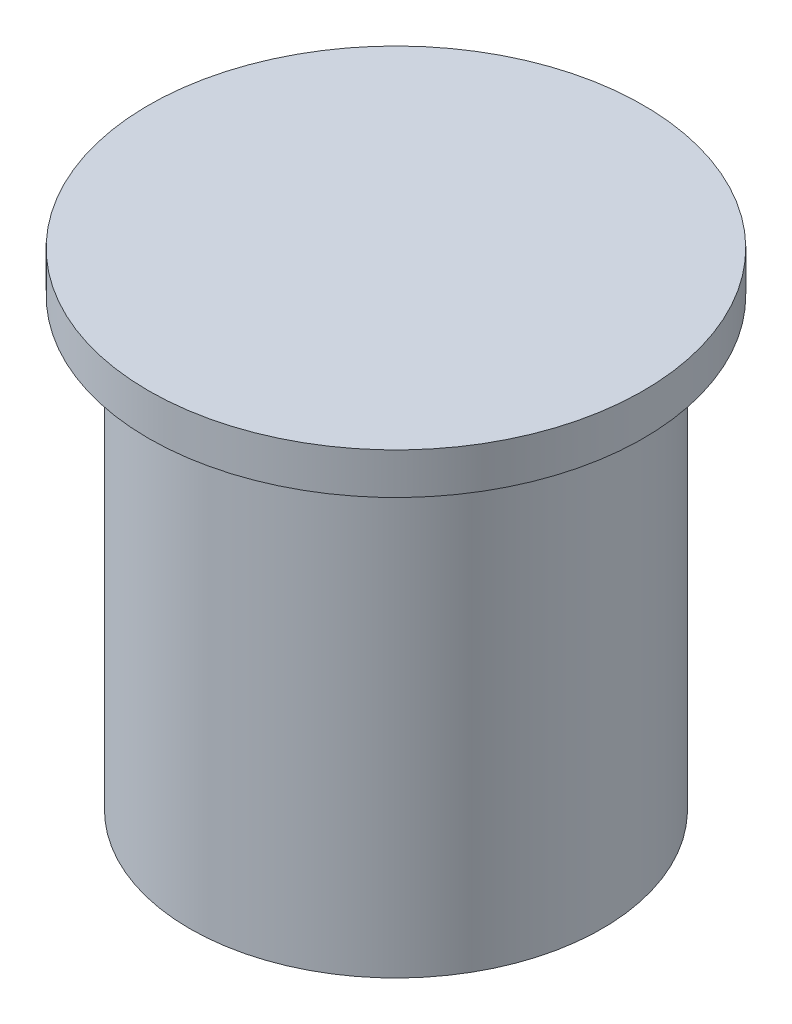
from build123d import *

# Parameters (mm, degrees)
SKETCH1_R           = 15.875
BOSS_EXTRUDE1_DEPTH = 34.29
SKETCH2_R           = 19.05
BOSS_EXTRUDE2_DEPTH = 3.175


with BuildPart() as part:
    # Sketch1 → Boss-Extrude1 (new body)
    with BuildSketch(Plane(origin=(0, 0, 0), x_dir=(1, 0, 0), z_dir=(0, 1, 0))):
        with Locations(Location((0, 0, 0), (0, 0, 270))):
            Circle(SKETCH1_R)
    extrude(amount=BOSS_EXTRUDE1_DEPTH)

    # Sketch2 → Boss-Extrude2 (add)
    with BuildSketch(Plane(origin=(0, 34.29, 0), x_dir=(1, 0, 0), z_dir=(0, 1, 0))):
        with Locations(Location((0, 0, 0), (0, 0, 270))):
            Circle(SKETCH2_R)
    extrude(amount=BOSS_EXTRUDE2_DEPTH)


solid = part.part
